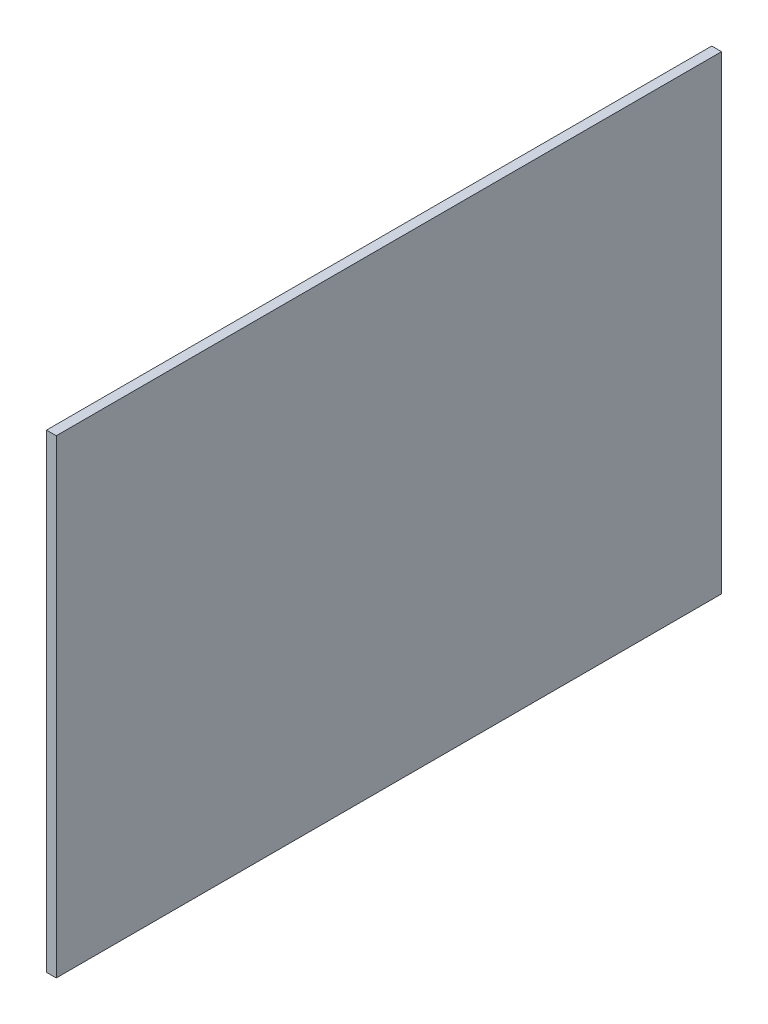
ISO-10303-21;
HEADER;
FILE_DESCRIPTION(('STEP AP214'),'2;1');
FILE_NAME('part.step','',(''),(''),'','','');
FILE_SCHEMA(('AUTOMOTIVE_DESIGN { 1 0 10303 214 1 1 1 1 }'));
ENDSEC;
DATA;
#1=APPLICATION_CONTEXT('core data for automotive mechanical design processes');
#2=APPLICATION_PROTOCOL_DEFINITION('international standard','automotive_design',2000,#1);
#3=PRODUCT_CONTEXT('',#1,'mechanical');
#4=PRODUCT('Part','Part','',(#3));
#5=PRODUCT_RELATED_PRODUCT_CATEGORY('part','',(#4));
#6=PRODUCT_DEFINITION_FORMATION('','',#4);
#7=PRODUCT_DEFINITION_CONTEXT('part definition',#1,'design');
#8=PRODUCT_DEFINITION('design','',#6,#7);
#9=PRODUCT_DEFINITION_SHAPE('','',#8);
#10=(LENGTH_UNIT() NAMED_UNIT(*) SI_UNIT(.MILLI.,.METRE.));
#11=(NAMED_UNIT(*) PLANE_ANGLE_UNIT() SI_UNIT($,.RADIAN.));
#12=(NAMED_UNIT(*) SI_UNIT($,.STERADIAN.) SOLID_ANGLE_UNIT());
#13=UNCERTAINTY_MEASURE_WITH_UNIT(LENGTH_MEASURE(1.E-05),#10,'distance_accuracy_value','');
#14=(GEOMETRIC_REPRESENTATION_CONTEXT(3) GLOBAL_UNCERTAINTY_ASSIGNED_CONTEXT((#13)) GLOBAL_UNIT_ASSIGNED_CONTEXT((#10,
#11,#12)) REPRESENTATION_CONTEXT('',''));
#15=CARTESIAN_POINT('',(0.,0.,0.));
#16=DIRECTION('',(0.,0.,1.));
#17=DIRECTION('',(1.,0.,0.));
#18=AXIS2_PLACEMENT_3D('',#15,#16,#17);
#19=CARTESIAN_POINT('',(0.,152.4,215.9));
#20=DIRECTION('',(0.,-1.,0.));
#21=DIRECTION('',(0.,0.,-1.));
#22=AXIS2_PLACEMENT_3D('',#19,#20,#21);
#23=PLANE('',#22);
#24=DIRECTION('',(-1.,0.,0.));
#25=VECTOR('',#24,1.);
#26=CARTESIAN_POINT('',(0.,152.4,-215.9));
#27=LINE('',#26,#25);
#28=CARTESIAN_POINT('',(6.35000000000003,152.4,-215.9));
#29=VERTEX_POINT('',#28);
#30=CARTESIAN_POINT('',(0.,152.4,-215.9));
#31=VERTEX_POINT('',#30);
#32=EDGE_CURVE('E94',#29,#31,#27,.T.);
#33=ORIENTED_EDGE('',*,*,#32,.T.);
#34=DIRECTION('',(0.,0.,-1.));
#35=VECTOR('',#34,1.);
#36=CARTESIAN_POINT('',(0.,152.4,215.9));
#37=LINE('',#36,#35);
#38=CARTESIAN_POINT('',(0.,152.4,215.9));
#39=VERTEX_POINT('',#38);
#40=EDGE_CURVE('E11',#39,#31,#37,.T.);
#41=ORIENTED_EDGE('',*,*,#40,.F.);
#42=DIRECTION('',(-1.,0.,0.));
#43=VECTOR('',#42,1.);
#44=CARTESIAN_POINT('',(0.,152.4,215.9));
#45=LINE('',#44,#43);
#46=CARTESIAN_POINT('',(6.35000000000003,152.4,215.9));
#47=VERTEX_POINT('',#46);
#48=EDGE_CURVE('E82',#47,#39,#45,.T.);
#49=ORIENTED_EDGE('',*,*,#48,.F.);
#50=DIRECTION('',(0.,0.,-1.));
#51=VECTOR('',#50,1.);
#52=CARTESIAN_POINT('',(6.35000000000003,152.4,215.9));
#53=LINE('',#52,#51);
#54=EDGE_CURVE('E90',#47,#29,#53,.T.);
#55=ORIENTED_EDGE('',*,*,#54,.T.);
#56=EDGE_LOOP('',(#33,#41,#49,#55));
#57=FACE_BOUND('',#56,.T.);
#58=ADVANCED_FACE('F31',(#57),#23,.F.);
#59=CARTESIAN_POINT('',(0.,-152.4,215.9));
#60=DIRECTION('',(1.,0.,0.));
#61=DIRECTION('',(0.,0.,-1.));
#62=AXIS2_PLACEMENT_3D('',#59,#60,#61);
#63=PLANE('',#62);
#64=DIRECTION('',(0.,-1.,0.));
#65=VECTOR('',#64,1.);
#66=CARTESIAN_POINT('',(0.,-152.4,-215.9));
#67=LINE('',#66,#65);
#68=CARTESIAN_POINT('',(0.,-152.4,-215.9));
#69=VERTEX_POINT('',#68);
#70=EDGE_CURVE('E86',#31,#69,#67,.T.);
#71=ORIENTED_EDGE('',*,*,#70,.T.);
#72=DIRECTION('',(0.,0.,-1.));
#73=VECTOR('',#72,1.);
#74=CARTESIAN_POINT('',(0.,-152.4,215.9));
#75=LINE('',#74,#73);
#76=CARTESIAN_POINT('',(0.,-152.4,215.9));
#77=VERTEX_POINT('',#76);
#78=EDGE_CURVE('E39',#77,#69,#75,.T.);
#79=ORIENTED_EDGE('',*,*,#78,.F.);
#80=DIRECTION('',(0.,-1.,0.));
#81=VECTOR('',#80,1.);
#82=CARTESIAN_POINT('',(0.,-152.4,215.9));
#83=LINE('',#82,#81);
#84=EDGE_CURVE('E77',#39,#77,#83,.T.);
#85=ORIENTED_EDGE('',*,*,#84,.F.);
#86=ORIENTED_EDGE('',*,*,#40,.T.);
#87=EDGE_LOOP('',(#71,#79,#85,#86));
#88=FACE_BOUND('',#87,.T.);
#89=ADVANCED_FACE('F85',(#88),#63,.F.);
#90=CARTESIAN_POINT('',(0.,-152.4,215.9));
#91=DIRECTION('',(0.,1.,0.));
#92=DIRECTION('',(0.,0.,1.));
#93=AXIS2_PLACEMENT_3D('',#90,#91,#92);
#94=PLANE('',#93);
#95=DIRECTION('',(1.,0.,0.));
#96=VECTOR('',#95,1.);
#97=CARTESIAN_POINT('',(0.,-152.4,-215.9));
#98=LINE('',#97,#96);
#99=CARTESIAN_POINT('',(6.35000000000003,-152.4,-215.9));
#100=VERTEX_POINT('',#99);
#101=EDGE_CURVE('E64',#69,#100,#98,.T.);
#102=ORIENTED_EDGE('',*,*,#101,.T.);
#103=DIRECTION('',(0.,0.,-1.));
#104=VECTOR('',#103,1.);
#105=CARTESIAN_POINT('',(6.35000000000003,-152.4,215.9));
#106=LINE('',#105,#104);
#107=CARTESIAN_POINT('',(6.35000000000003,-152.4,215.9));
#108=VERTEX_POINT('',#107);
#109=EDGE_CURVE('E87',#108,#100,#106,.T.);
#110=ORIENTED_EDGE('',*,*,#109,.F.);
#111=DIRECTION('',(1.,0.,0.));
#112=VECTOR('',#111,1.);
#113=CARTESIAN_POINT('',(0.,-152.4,215.9));
#114=LINE('',#113,#112);
#115=EDGE_CURVE('E80',#77,#108,#114,.T.);
#116=ORIENTED_EDGE('',*,*,#115,.F.);
#117=ORIENTED_EDGE('',*,*,#78,.T.);
#118=EDGE_LOOP('',(#102,#110,#116,#117));
#119=FACE_BOUND('',#118,.T.);
#120=ADVANCED_FACE('F88',(#119),#94,.F.);
#121=CARTESIAN_POINT('',(6.35000000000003,152.4,215.9));
#122=DIRECTION('',(-1.,0.,0.));
#123=DIRECTION('',(0.,0.,1.));
#124=AXIS2_PLACEMENT_3D('',#121,#122,#123);
#125=PLANE('',#124);
#126=DIRECTION('',(0.,1.,0.));
#127=VECTOR('',#126,1.);
#128=CARTESIAN_POINT('',(6.35000000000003,152.4,-215.9));
#129=LINE('',#128,#127);
#130=EDGE_CURVE('E70',#100,#29,#129,.T.);
#131=ORIENTED_EDGE('',*,*,#130,.T.);
#132=ORIENTED_EDGE('',*,*,#54,.F.);
#133=DIRECTION('',(0.,1.,0.));
#134=VECTOR('',#133,1.);
#135=CARTESIAN_POINT('',(6.35000000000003,152.4,215.9));
#136=LINE('',#135,#134);
#137=EDGE_CURVE('E47',#108,#47,#136,.T.);
#138=ORIENTED_EDGE('',*,*,#137,.F.);
#139=ORIENTED_EDGE('',*,*,#109,.T.);
#140=EDGE_LOOP('',(#131,#132,#138,#139));
#141=FACE_BOUND('',#140,.T.);
#142=ADVANCED_FACE('F101',(#141),#125,.F.);
#143=CARTESIAN_POINT('',(6.35000000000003,152.4,215.9));
#144=DIRECTION('',(0.,0.,-1.));
#145=DIRECTION('',(-1.,0.,0.));
#146=AXIS2_PLACEMENT_3D('',#143,#144,#145);
#147=PLANE('',#146);
#148=ORIENTED_EDGE('',*,*,#48,.T.);
#149=ORIENTED_EDGE('',*,*,#84,.T.);
#150=ORIENTED_EDGE('',*,*,#115,.T.);
#151=ORIENTED_EDGE('',*,*,#137,.T.);
#152=EDGE_LOOP('',(#148,#149,#150,#151));
#153=FACE_BOUND('',#152,.T.);
#154=ADVANCED_FACE('F78',(#153),#147,.F.);
#155=CARTESIAN_POINT('',(6.35000000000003,152.4,-215.9));
#156=DIRECTION('',(0.,0.,-1.));
#157=DIRECTION('',(-1.,0.,0.));
#158=AXIS2_PLACEMENT_3D('',#155,#156,#157);
#159=PLANE('',#158);
#160=ORIENTED_EDGE('',*,*,#32,.F.);
#161=ORIENTED_EDGE('',*,*,#130,.F.);
#162=ORIENTED_EDGE('',*,*,#101,.F.);
#163=ORIENTED_EDGE('',*,*,#70,.F.);
#164=EDGE_LOOP('',(#160,#161,#162,#163));
#165=FACE_BOUND('',#164,.T.);
#166=ADVANCED_FACE('F104',(#165),#159,.T.);
#167=CLOSED_SHELL('',(#58,#89,#120,#142,#154,#166));
#168=MANIFOLD_SOLID_BREP('B2',#167);
#169=ADVANCED_BREP_SHAPE_REPRESENTATION('',(#18,#168),#14);
#170=SHAPE_DEFINITION_REPRESENTATION(#9,#169);
ENDSEC;
END-ISO-10303-21;
